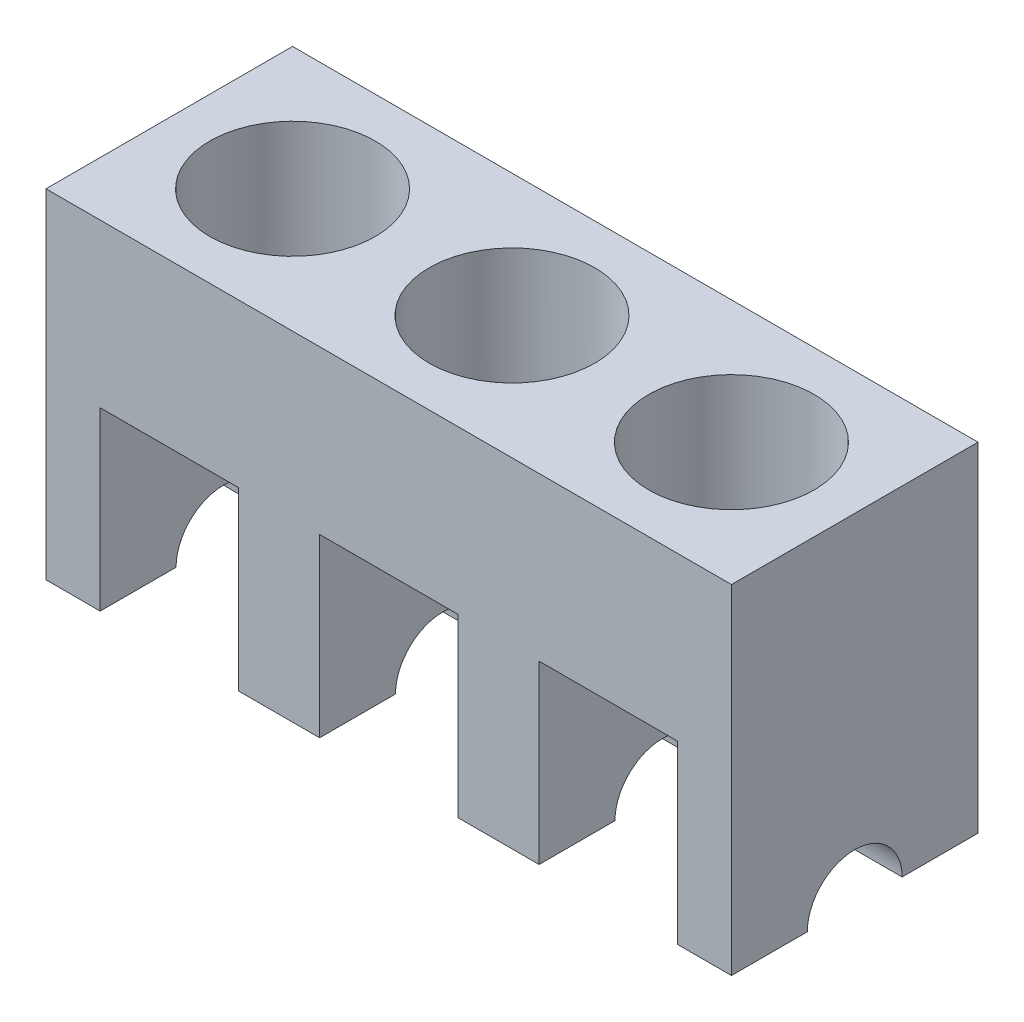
from build123d import *

# Parameters (mm, degrees)
SKETCH2_W               = 253
SKETCH2_H               = 91
BOSS_EXTRUDE1_DEPTH     = 125
SKETCH3_R               = 30.55
CUT_EXTRUDE1_DEPTH      = 81
CUT_EXTRUDE2_DEPTH      = 184.568788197
CUT_EXTRUDE2_DEPTH_BACK = 184.568788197
SKETCH4_W               = 51
SKETCH4_H               = 130
CUT_EXTRUDE3_DEPTH      = 184.568788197
CUT_EXTRUDE3_DEPTH_BACK = 184.568788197
SKETCH5_R               = 17.5


with BuildPart() as part:
    # Sketch2 → Boss-Extrude1 (new body)
    with BuildSketch(Plane(origin=(0, 125, 0), x_dir=(1, 0, 0), z_dir=(0, 1, 0))):
        Rectangle(SKETCH2_W, SKETCH2_H)
    extrude(amount=-BOSS_EXTRUDE1_DEPTH)

    # Sketch3 → Cut-Extrude1 (cut)
    with BuildSketch(Plane(origin=(0, 125, 0), x_dir=(1, 0, 0), z_dir=(0, 1, 0))):
        with Locations(Location((-81, 0, 0), (0, 0, 270))):
            Circle(SKETCH3_R)
        with Locations(Location((0, 0, 0), (0, 0, 270))):
            Circle(SKETCH3_R)
        with Locations(Location((81, 0, 0), (0, 0, 270))):
            Circle(SKETCH3_R)
    extrude(amount=-CUT_EXTRUDE1_DEPTH, mode=Mode.SUBTRACT)

    # Sketch4 → Cut-Extrude2 (cut, two sides: drawn at the far end of the back side and taken through both)
    with BuildSketch(Plane.XY.offset(-CUT_EXTRUDE2_DEPTH_BACK)):
        with Locations((-81, 0)):
            Rectangle(SKETCH4_W, SKETCH4_H)
        with Locations((81, 0)):
            Rectangle(SKETCH4_W, SKETCH4_H)
        Rectangle(SKETCH4_W, SKETCH4_H)
    extrude(amount=CUT_EXTRUDE2_DEPTH + CUT_EXTRUDE2_DEPTH_BACK, mode=Mode.SUBTRACT)

    # Sketch5 → Cut-Extrude3 (cut, two sides: drawn at the far end of the back side and taken through both)
    with BuildSketch(Plane(origin=(0, 0, 0), x_dir=(0, 0, -1), z_dir=(1, 0, 0)).offset(-CUT_EXTRUDE3_DEPTH_BACK)):
        Circle(SKETCH5_R)
    extrude(amount=CUT_EXTRUDE3_DEPTH + CUT_EXTRUDE3_DEPTH_BACK, mode=Mode.SUBTRACT)


solid = part.part
